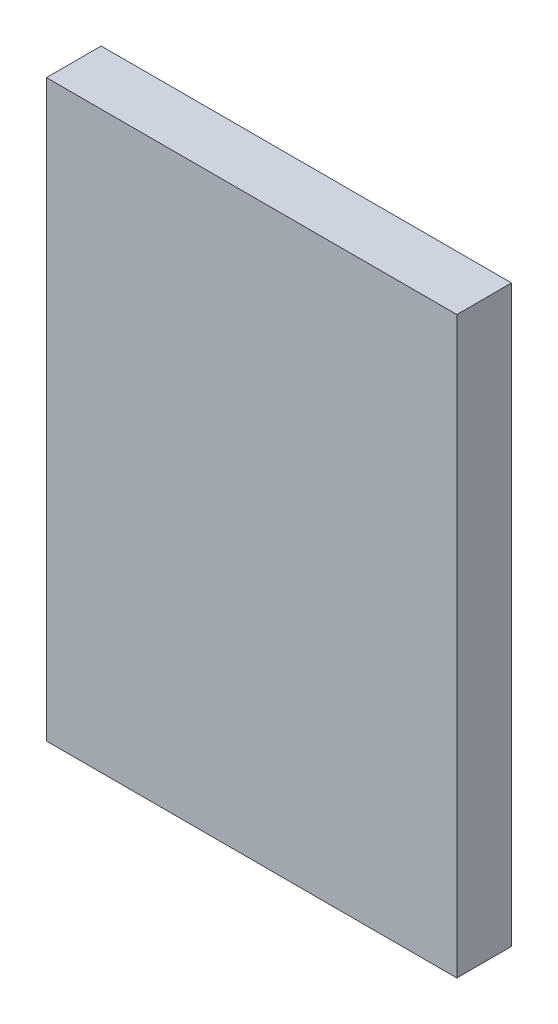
ISO-10303-21;
HEADER;
FILE_DESCRIPTION(('STEP AP214'),'2;1');
FILE_NAME('part.step','',(''),(''),'','','');
FILE_SCHEMA(('AUTOMOTIVE_DESIGN { 1 0 10303 214 1 1 1 1 }'));
ENDSEC;
DATA;
#1=APPLICATION_CONTEXT('core data for automotive mechanical design processes');
#2=APPLICATION_PROTOCOL_DEFINITION('international standard','automotive_design',2000,#1);
#3=PRODUCT_CONTEXT('',#1,'mechanical');
#4=PRODUCT('Part','Part','',(#3));
#5=PRODUCT_RELATED_PRODUCT_CATEGORY('part','',(#4));
#6=PRODUCT_DEFINITION_FORMATION('','',#4);
#7=PRODUCT_DEFINITION_CONTEXT('part definition',#1,'design');
#8=PRODUCT_DEFINITION('design','',#6,#7);
#9=PRODUCT_DEFINITION_SHAPE('','',#8);
#10=(LENGTH_UNIT() NAMED_UNIT(*) SI_UNIT(.MILLI.,.METRE.));
#11=(NAMED_UNIT(*) PLANE_ANGLE_UNIT() SI_UNIT($,.RADIAN.));
#12=(NAMED_UNIT(*) SI_UNIT($,.STERADIAN.) SOLID_ANGLE_UNIT());
#13=UNCERTAINTY_MEASURE_WITH_UNIT(LENGTH_MEASURE(1.E-05),#10,'distance_accuracy_value','');
#14=(GEOMETRIC_REPRESENTATION_CONTEXT(3) GLOBAL_UNCERTAINTY_ASSIGNED_CONTEXT((#13)) GLOBAL_UNIT_ASSIGNED_CONTEXT((#10,
#11,#12)) REPRESENTATION_CONTEXT('',''));
#15=CARTESIAN_POINT('',(0.,0.,0.));
#16=DIRECTION('',(0.,0.,1.));
#17=DIRECTION('',(1.,0.,0.));
#18=AXIS2_PLACEMENT_3D('',#15,#16,#17);
#19=CARTESIAN_POINT('',(-15.,-21.,9.85));
#20=DIRECTION('',(1.,0.,0.));
#21=DIRECTION('',(0.,0.,-1.));
#22=AXIS2_PLACEMENT_3D('',#19,#20,#21);
#23=PLANE('',#22);
#24=DIRECTION('',(0.,-1.,0.));
#25=VECTOR('',#24,1.);
#26=CARTESIAN_POINT('',(-15.,-21.,5.85));
#27=LINE('',#26,#25);
#28=CARTESIAN_POINT('',(-15.,21.,5.85));
#29=VERTEX_POINT('',#28);
#30=CARTESIAN_POINT('',(-15.,-21.,5.85));
#31=VERTEX_POINT('',#30);
#32=EDGE_CURVE('E102',#29,#31,#27,.T.);
#33=ORIENTED_EDGE('',*,*,#32,.T.);
#34=DIRECTION('',(0.,0.,-1.));
#35=VECTOR('',#34,1.);
#36=CARTESIAN_POINT('',(-15.,-21.,9.85));
#37=LINE('',#36,#35);
#38=CARTESIAN_POINT('',(-15.,-21.,9.85));
#39=VERTEX_POINT('',#38);
#40=EDGE_CURVE('E11',#39,#31,#37,.T.);
#41=ORIENTED_EDGE('',*,*,#40,.F.);
#42=DIRECTION('',(0.,-1.,0.));
#43=VECTOR('',#42,1.);
#44=CARTESIAN_POINT('',(-15.,-21.,9.85));
#45=LINE('',#44,#43);
#46=CARTESIAN_POINT('',(-15.,21.,9.85));
#47=VERTEX_POINT('',#46);
#48=EDGE_CURVE('E95',#47,#39,#45,.T.);
#49=ORIENTED_EDGE('',*,*,#48,.F.);
#50=DIRECTION('',(0.,0.,-1.));
#51=VECTOR('',#50,1.);
#52=CARTESIAN_POINT('',(-15.,21.,9.85));
#53=LINE('',#52,#51);
#54=EDGE_CURVE('E99',#47,#29,#53,.T.);
#55=ORIENTED_EDGE('',*,*,#54,.T.);
#56=EDGE_LOOP('',(#33,#41,#49,#55));
#57=FACE_BOUND('',#56,.T.);
#58=ADVANCED_FACE('F41',(#57),#23,.F.);
#59=CARTESIAN_POINT('',(-15.,-21.,9.85));
#60=DIRECTION('',(0.,1.,0.));
#61=DIRECTION('',(0.,0.,1.));
#62=AXIS2_PLACEMENT_3D('',#59,#60,#61);
#63=PLANE('',#62);
#64=DIRECTION('',(1.,0.,0.));
#65=VECTOR('',#64,1.);
#66=CARTESIAN_POINT('',(-15.,-21.,5.85));
#67=LINE('',#66,#65);
#68=CARTESIAN_POINT('',(15.,-21.,5.85));
#69=VERTEX_POINT('',#68);
#70=EDGE_CURVE('E96',#31,#69,#67,.T.);
#71=ORIENTED_EDGE('',*,*,#70,.T.);
#72=DIRECTION('',(0.,0.,-1.));
#73=VECTOR('',#72,1.);
#74=CARTESIAN_POINT('',(15.,-21.,9.85));
#75=LINE('',#74,#73);
#76=CARTESIAN_POINT('',(15.,-21.,9.85));
#77=VERTEX_POINT('',#76);
#78=EDGE_CURVE('E47',#77,#69,#75,.T.);
#79=ORIENTED_EDGE('',*,*,#78,.F.);
#80=DIRECTION('',(1.,0.,0.));
#81=VECTOR('',#80,1.);
#82=CARTESIAN_POINT('',(-15.,-21.,9.85));
#83=LINE('',#82,#81);
#84=EDGE_CURVE('E87',#39,#77,#83,.T.);
#85=ORIENTED_EDGE('',*,*,#84,.F.);
#86=ORIENTED_EDGE('',*,*,#40,.T.);
#87=EDGE_LOOP('',(#71,#79,#85,#86));
#88=FACE_BOUND('',#87,.T.);
#89=ADVANCED_FACE('F92',(#88),#63,.F.);
#90=CARTESIAN_POINT('',(15.,-21.,9.85));
#91=DIRECTION('',(-1.,0.,0.));
#92=DIRECTION('',(0.,0.,1.));
#93=AXIS2_PLACEMENT_3D('',#90,#91,#92);
#94=PLANE('',#93);
#95=DIRECTION('',(0.,1.,0.));
#96=VECTOR('',#95,1.);
#97=CARTESIAN_POINT('',(15.,-21.,5.85));
#98=LINE('',#97,#96);
#99=CARTESIAN_POINT('',(15.,21.,5.85));
#100=VERTEX_POINT('',#99);
#101=EDGE_CURVE('E74',#69,#100,#98,.T.);
#102=ORIENTED_EDGE('',*,*,#101,.T.);
#103=DIRECTION('',(0.,0.,-1.));
#104=VECTOR('',#103,1.);
#105=CARTESIAN_POINT('',(15.,21.,9.85));
#106=LINE('',#105,#104);
#107=CARTESIAN_POINT('',(15.,21.,9.85));
#108=VERTEX_POINT('',#107);
#109=EDGE_CURVE('E100',#108,#100,#106,.T.);
#110=ORIENTED_EDGE('',*,*,#109,.F.);
#111=DIRECTION('',(0.,1.,0.));
#112=VECTOR('',#111,1.);
#113=CARTESIAN_POINT('',(15.,-21.,9.85));
#114=LINE('',#113,#112);
#115=EDGE_CURVE('E89',#77,#108,#114,.T.);
#116=ORIENTED_EDGE('',*,*,#115,.F.);
#117=ORIENTED_EDGE('',*,*,#78,.T.);
#118=EDGE_LOOP('',(#102,#110,#116,#117));
#119=FACE_BOUND('',#118,.T.);
#120=ADVANCED_FACE('F98',(#119),#94,.F.);
#121=CARTESIAN_POINT('',(-15.,21.,9.85));
#122=DIRECTION('',(0.,-1.,0.));
#123=DIRECTION('',(0.,0.,-1.));
#124=AXIS2_PLACEMENT_3D('',#121,#122,#123);
#125=PLANE('',#124);
#126=DIRECTION('',(-1.,0.,0.));
#127=VECTOR('',#126,1.);
#128=CARTESIAN_POINT('',(-15.,21.,5.85));
#129=LINE('',#128,#127);
#130=EDGE_CURVE('E76',#100,#29,#129,.T.);
#131=ORIENTED_EDGE('',*,*,#130,.T.);
#132=ORIENTED_EDGE('',*,*,#54,.F.);
#133=DIRECTION('',(-1.,0.,0.));
#134=VECTOR('',#133,1.);
#135=CARTESIAN_POINT('',(-15.,21.,9.85));
#136=LINE('',#135,#134);
#137=EDGE_CURVE('E60',#108,#47,#136,.T.);
#138=ORIENTED_EDGE('',*,*,#137,.F.);
#139=ORIENTED_EDGE('',*,*,#109,.T.);
#140=EDGE_LOOP('',(#131,#132,#138,#139));
#141=FACE_BOUND('',#140,.T.);
#142=ADVANCED_FACE('F112',(#141),#125,.F.);
#143=CARTESIAN_POINT('',(0.,0.,9.85));
#144=DIRECTION('',(0.,0.,-1.));
#145=DIRECTION('',(-1.,0.,0.));
#146=AXIS2_PLACEMENT_3D('',#143,#144,#145);
#147=PLANE('',#146);
#148=ORIENTED_EDGE('',*,*,#48,.T.);
#149=ORIENTED_EDGE('',*,*,#84,.T.);
#150=ORIENTED_EDGE('',*,*,#115,.T.);
#151=ORIENTED_EDGE('',*,*,#137,.T.);
#152=EDGE_LOOP('',(#148,#149,#150,#151));
#153=FACE_BOUND('',#152,.T.);
#154=ADVANCED_FACE('F86',(#153),#147,.F.);
#155=CARTESIAN_POINT('',(0.,0.,5.85));
#156=DIRECTION('',(0.,0.,-1.));
#157=DIRECTION('',(-1.,0.,0.));
#158=AXIS2_PLACEMENT_3D('',#155,#156,#157);
#159=PLANE('',#158);
#160=ORIENTED_EDGE('',*,*,#32,.F.);
#161=ORIENTED_EDGE('',*,*,#130,.F.);
#162=ORIENTED_EDGE('',*,*,#101,.F.);
#163=ORIENTED_EDGE('',*,*,#70,.F.);
#164=EDGE_LOOP('',(#160,#161,#162,#163));
#165=FACE_BOUND('',#164,.T.);
#166=ADVANCED_FACE('F111',(#165),#159,.T.);
#167=CLOSED_SHELL('',(#58,#89,#120,#142,#154,#166));
#168=MANIFOLD_SOLID_BREP('B2',#167);
#169=ADVANCED_BREP_SHAPE_REPRESENTATION('',(#18,#168),#14);
#170=SHAPE_DEFINITION_REPRESENTATION(#9,#169);
ENDSEC;
END-ISO-10303-21;
